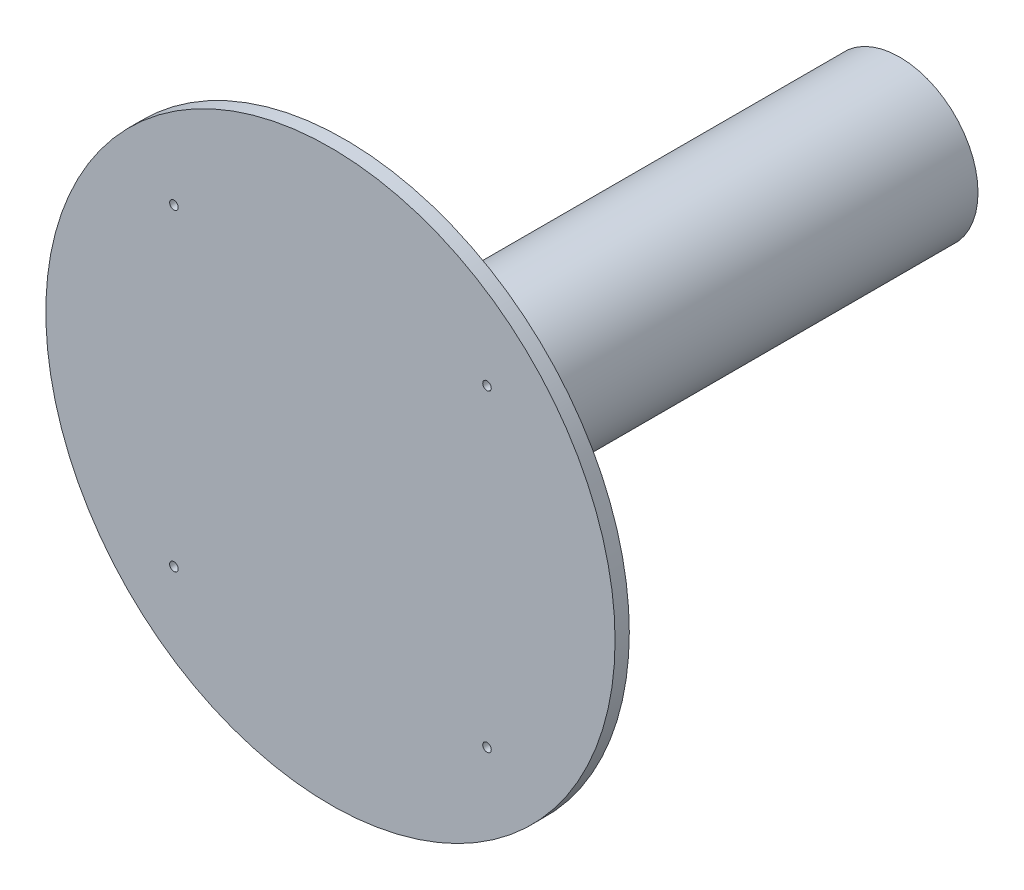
ISO-10303-21;
HEADER;
FILE_DESCRIPTION(('STEP AP214'),'2;1');
FILE_NAME('part.step','',(''),(''),'','','');
FILE_SCHEMA(('AUTOMOTIVE_DESIGN { 1 0 10303 214 1 1 1 1 }'));
ENDSEC;
DATA;
#1=APPLICATION_CONTEXT('core data for automotive mechanical design processes');
#2=APPLICATION_PROTOCOL_DEFINITION('international standard','automotive_design',2000,#1);
#3=PRODUCT_CONTEXT('',#1,'mechanical');
#4=PRODUCT('Part','Part','',(#3));
#5=PRODUCT_RELATED_PRODUCT_CATEGORY('part','',(#4));
#6=PRODUCT_DEFINITION_FORMATION('','',#4);
#7=PRODUCT_DEFINITION_CONTEXT('part definition',#1,'design');
#8=PRODUCT_DEFINITION('design','',#6,#7);
#9=PRODUCT_DEFINITION_SHAPE('','',#8);
#10=(LENGTH_UNIT() NAMED_UNIT(*) SI_UNIT(.MILLI.,.METRE.));
#11=(NAMED_UNIT(*) PLANE_ANGLE_UNIT() SI_UNIT($,.RADIAN.));
#12=(NAMED_UNIT(*) SI_UNIT($,.STERADIAN.) SOLID_ANGLE_UNIT());
#13=UNCERTAINTY_MEASURE_WITH_UNIT(LENGTH_MEASURE(1.E-05),#10,'distance_accuracy_value','');
#14=(GEOMETRIC_REPRESENTATION_CONTEXT(3) GLOBAL_UNCERTAINTY_ASSIGNED_CONTEXT((#13)) GLOBAL_UNIT_ASSIGNED_CONTEXT((#10,
#11,#12)) REPRESENTATION_CONTEXT('',''));
#15=CARTESIAN_POINT('',(0.,0.,0.));
#16=DIRECTION('',(0.,0.,1.));
#17=DIRECTION('',(1.,0.,0.));
#18=AXIS2_PLACEMENT_3D('',#15,#16,#17);
#19=CARTESIAN_POINT('',(0.,0.,5.));
#20=DIRECTION('',(0.,0.,-1.));
#21=DIRECTION('',(-1.,0.,0.));
#22=AXIS2_PLACEMENT_3D('',#19,#20,#21);
#23=CYLINDRICAL_SURFACE('',#22,100.);
#24=CARTESIAN_POINT('',(0.,0.,5.));
#25=DIRECTION('',(0.,0.,1.));
#26=DIRECTION('',(1.,0.,0.));
#27=AXIS2_PLACEMENT_3D('',#24,#25,#26);
#28=CIRCLE('',#27,100.);
#29=CARTESIAN_POINT('',(100.,0.,5.));
#30=VERTEX_POINT('',#29);
#31=EDGE_CURVE('E37',#30,#30,#28,.T.);
#32=ORIENTED_EDGE('',*,*,#31,.F.);
#33=EDGE_LOOP('',(#32));
#34=FACE_BOUND('',#33,.T.);
#35=CARTESIAN_POINT('',(0.,0.,0.));
#36=DIRECTION('',(0.,0.,1.));
#37=DIRECTION('',(1.,0.,0.));
#38=AXIS2_PLACEMENT_3D('',#35,#36,#37);
#39=CIRCLE('',#38,100.);
#40=CARTESIAN_POINT('',(100.,0.,0.));
#41=VERTEX_POINT('',#40);
#42=EDGE_CURVE('E41',#41,#41,#39,.T.);
#43=ORIENTED_EDGE('',*,*,#42,.T.);
#44=EDGE_LOOP('',(#43));
#45=FACE_BOUND('',#44,.T.);
#46=ADVANCED_FACE('F31',(#34,#45),#23,.T.);
#47=CARTESIAN_POINT('',(0.,0.,5.));
#48=DIRECTION('',(0.,0.,1.));
#49=DIRECTION('',(1.,0.,0.));
#50=AXIS2_PLACEMENT_3D('',#47,#48,#49);
#51=PLANE('',#50);
#52=CARTESIAN_POINT('',(55.,-55.,5.));
#53=DIRECTION('',(0.,0.,1.));
#54=DIRECTION('',(1.,0.,0.));
#55=AXIS2_PLACEMENT_3D('',#52,#53,#54);
#56=CIRCLE('',#55,1.5);
#57=CARTESIAN_POINT('',(56.5,-55.,5.));
#58=VERTEX_POINT('',#57);
#59=EDGE_CURVE('E77',#58,#58,#56,.T.);
#60=ORIENTED_EDGE('',*,*,#59,.F.);
#61=EDGE_LOOP('',(#60));
#62=FACE_BOUND('',#61,.T.);
#63=CARTESIAN_POINT('',(-55.,-55.,5.));
#64=DIRECTION('',(0.,0.,1.));
#65=DIRECTION('',(1.,0.,0.));
#66=AXIS2_PLACEMENT_3D('',#63,#64,#65);
#67=CIRCLE('',#66,1.5);
#68=CARTESIAN_POINT('',(-53.5,-55.,5.));
#69=VERTEX_POINT('',#68);
#70=EDGE_CURVE('E71',#69,#69,#67,.T.);
#71=ORIENTED_EDGE('',*,*,#70,.F.);
#72=EDGE_LOOP('',(#71));
#73=FACE_BOUND('',#72,.T.);
#74=CARTESIAN_POINT('',(55.,55.,5.));
#75=DIRECTION('',(0.,0.,1.));
#76=DIRECTION('',(1.,0.,0.));
#77=AXIS2_PLACEMENT_3D('',#74,#75,#76);
#78=CIRCLE('',#77,1.5);
#79=CARTESIAN_POINT('',(56.5,55.,5.));
#80=VERTEX_POINT('',#79);
#81=EDGE_CURVE('E65',#80,#80,#78,.T.);
#82=ORIENTED_EDGE('',*,*,#81,.F.);
#83=EDGE_LOOP('',(#82));
#84=FACE_BOUND('',#83,.T.);
#85=CARTESIAN_POINT('',(-55.,55.,5.));
#86=DIRECTION('',(0.,0.,1.));
#87=DIRECTION('',(1.,0.,0.));
#88=AXIS2_PLACEMENT_3D('',#85,#86,#87);
#89=CIRCLE('',#88,1.5);
#90=CARTESIAN_POINT('',(-53.5,55.,5.));
#91=VERTEX_POINT('',#90);
#92=EDGE_CURVE('E59',#91,#91,#89,.T.);
#93=ORIENTED_EDGE('',*,*,#92,.F.);
#94=EDGE_LOOP('',(#93));
#95=FACE_BOUND('',#94,.T.);
#96=ORIENTED_EDGE('',*,*,#31,.T.);
#97=EDGE_LOOP('',(#96));
#98=FACE_BOUND('',#97,.T.);
#99=ADVANCED_FACE('F83',(#62,#73,#84,#95,#98),#51,.T.);
#100=CARTESIAN_POINT('',(0.,0.,0.));
#101=DIRECTION('',(0.,0.,1.));
#102=DIRECTION('',(1.,0.,0.));
#103=AXIS2_PLACEMENT_3D('',#100,#101,#102);
#104=PLANE('',#103);
#105=CARTESIAN_POINT('',(55.,-55.,0.));
#106=DIRECTION('',(0.,0.,1.));
#107=DIRECTION('',(1.,0.,0.));
#108=AXIS2_PLACEMENT_3D('',#105,#106,#107);
#109=CIRCLE('',#108,1.5);
#110=CARTESIAN_POINT('',(56.5,-55.,0.));
#111=VERTEX_POINT('',#110);
#112=EDGE_CURVE('E74',#111,#111,#109,.T.);
#113=ORIENTED_EDGE('',*,*,#112,.T.);
#114=EDGE_LOOP('',(#113));
#115=FACE_BOUND('',#114,.T.);
#116=CARTESIAN_POINT('',(-55.,-55.,0.));
#117=DIRECTION('',(0.,0.,1.));
#118=DIRECTION('',(1.,0.,0.));
#119=AXIS2_PLACEMENT_3D('',#116,#117,#118);
#120=CIRCLE('',#119,1.5);
#121=CARTESIAN_POINT('',(-53.5,-55.,0.));
#122=VERTEX_POINT('',#121);
#123=EDGE_CURVE('E68',#122,#122,#120,.T.);
#124=ORIENTED_EDGE('',*,*,#123,.T.);
#125=EDGE_LOOP('',(#124));
#126=FACE_BOUND('',#125,.T.);
#127=CARTESIAN_POINT('',(55.,55.,0.));
#128=DIRECTION('',(0.,0.,1.));
#129=DIRECTION('',(1.,0.,0.));
#130=AXIS2_PLACEMENT_3D('',#127,#128,#129);
#131=CIRCLE('',#130,1.5);
#132=CARTESIAN_POINT('',(56.5,55.,0.));
#133=VERTEX_POINT('',#132);
#134=EDGE_CURVE('E62',#133,#133,#131,.T.);
#135=ORIENTED_EDGE('',*,*,#134,.T.);
#136=EDGE_LOOP('',(#135));
#137=FACE_BOUND('',#136,.T.);
#138=CARTESIAN_POINT('',(-55.,55.,0.));
#139=DIRECTION('',(0.,0.,1.));
#140=DIRECTION('',(1.,0.,0.));
#141=AXIS2_PLACEMENT_3D('',#138,#139,#140);
#142=CIRCLE('',#141,1.5);
#143=CARTESIAN_POINT('',(-53.5,55.,0.));
#144=VERTEX_POINT('',#143);
#145=EDGE_CURVE('E54',#144,#144,#142,.T.);
#146=ORIENTED_EDGE('',*,*,#145,.T.);
#147=EDGE_LOOP('',(#146));
#148=FACE_BOUND('',#147,.T.);
#149=CARTESIAN_POINT('',(0.,0.,0.));
#150=DIRECTION('',(0.,0.,1.));
#151=DIRECTION('',(1.,0.,0.));
#152=AXIS2_PLACEMENT_3D('',#149,#150,#151);
#153=CIRCLE('',#152,27.5);
#154=CARTESIAN_POINT('',(27.5,0.,0.));
#155=VERTEX_POINT('',#154);
#156=EDGE_CURVE('E10',#155,#155,#153,.F.);
#157=ORIENTED_EDGE('',*,*,#156,.F.);
#158=EDGE_LOOP('',(#157));
#159=FACE_BOUND('',#158,.T.);
#160=ORIENTED_EDGE('',*,*,#42,.F.);
#161=EDGE_LOOP('',(#160));
#162=FACE_BOUND('',#161,.T.);
#163=ADVANCED_FACE('F86',(#115,#126,#137,#148,#159,#162),#104,.F.);
#164=CARTESIAN_POINT('',(0.,0.,-195.));
#165=DIRECTION('',(0.,0.,-1.));
#166=DIRECTION('',(-1.,0.,0.));
#167=AXIS2_PLACEMENT_3D('',#164,#165,#166);
#168=PLANE('',#167);
#169=CARTESIAN_POINT('',(0.,0.,-195.));
#170=DIRECTION('',(0.,0.,-1.));
#171=DIRECTION('',(-1.,0.,0.));
#172=AXIS2_PLACEMENT_3D('',#169,#170,#171);
#173=CIRCLE('',#172,27.5);
#174=CARTESIAN_POINT('',(-27.5,0.,-195.));
#175=VERTEX_POINT('',#174);
#176=EDGE_CURVE('E46',#175,#175,#173,.T.);
#177=ORIENTED_EDGE('',*,*,#176,.T.);
#178=EDGE_LOOP('',(#177));
#179=FACE_BOUND('',#178,.T.);
#180=CARTESIAN_POINT('',(0.,0.,-195.));
#181=DIRECTION('',(0.,0.,-1.));
#182=DIRECTION('',(-1.,0.,0.));
#183=AXIS2_PLACEMENT_3D('',#180,#181,#182);
#184=CIRCLE('',#183,22.5);
#185=CARTESIAN_POINT('',(-22.5,0.,-195.));
#186=VERTEX_POINT('',#185);
#187=EDGE_CURVE('E50',#186,#186,#184,.T.);
#188=ORIENTED_EDGE('',*,*,#187,.F.);
#189=EDGE_LOOP('',(#188));
#190=FACE_BOUND('',#189,.T.);
#191=ADVANCED_FACE('F119',(#179,#190),#168,.T.);
#192=CARTESIAN_POINT('',(0.,0.,-195.));
#193=DIRECTION('',(0.,0.,1.));
#194=DIRECTION('',(1.,0.,0.));
#195=AXIS2_PLACEMENT_3D('',#192,#193,#194);
#196=CYLINDRICAL_SURFACE('',#195,27.5);
#197=ORIENTED_EDGE('',*,*,#176,.F.);
#198=EDGE_LOOP('',(#197));
#199=FACE_BOUND('',#198,.T.);
#200=ORIENTED_EDGE('',*,*,#156,.T.);
#201=EDGE_LOOP('',(#200));
#202=FACE_BOUND('',#201,.T.);
#203=ADVANCED_FACE('F124',(#199,#202),#196,.T.);
#204=CARTESIAN_POINT('',(0.,0.,-195.));
#205=DIRECTION('',(0.,0.,1.));
#206=DIRECTION('',(1.,0.,0.));
#207=AXIS2_PLACEMENT_3D('',#204,#205,#206);
#208=CYLINDRICAL_SURFACE('',#207,22.5);
#209=ORIENTED_EDGE('',*,*,#187,.T.);
#210=EDGE_LOOP('',(#209));
#211=FACE_BOUND('',#210,.T.);
#212=CARTESIAN_POINT('',(0.,0.,0.));
#213=DIRECTION('',(0.,0.,-1.));
#214=DIRECTION('',(-1.,0.,0.));
#215=AXIS2_PLACEMENT_3D('',#212,#213,#214);
#216=CIRCLE('',#215,22.5);
#217=CARTESIAN_POINT('',(-22.5,0.,0.));
#218=VERTEX_POINT('',#217);
#219=EDGE_CURVE('E51',#218,#218,#216,.T.);
#220=ORIENTED_EDGE('',*,*,#219,.F.);
#221=EDGE_LOOP('',(#220));
#222=FACE_BOUND('',#221,.T.);
#223=ADVANCED_FACE('F107',(#211,#222),#208,.F.);
#224=ORIENTED_EDGE('',*,*,#219,.T.);
#225=EDGE_LOOP('',(#224));
#226=FACE_BOUND('',#225,.T.);
#227=ADVANCED_FACE('F97',(#226),#104,.F.);
#228=CARTESIAN_POINT('',(-55.,55.,5.));
#229=DIRECTION('',(0.,0.,1.));
#230=DIRECTION('',(1.,0.,0.));
#231=AXIS2_PLACEMENT_3D('',#228,#229,#230);
#232=CYLINDRICAL_SURFACE('',#231,1.5);
#233=ORIENTED_EDGE('',*,*,#145,.F.);
#234=EDGE_LOOP('',(#233));
#235=FACE_BOUND('',#234,.T.);
#236=ORIENTED_EDGE('',*,*,#92,.T.);
#237=EDGE_LOOP('',(#236));
#238=FACE_BOUND('',#237,.T.);
#239=ADVANCED_FACE('F94',(#235,#238),#232,.F.);
#240=CARTESIAN_POINT('',(55.,55.,5.));
#241=DIRECTION('',(0.,0.,1.));
#242=DIRECTION('',(1.,0.,0.));
#243=AXIS2_PLACEMENT_3D('',#240,#241,#242);
#244=CYLINDRICAL_SURFACE('',#243,1.5);
#245=ORIENTED_EDGE('',*,*,#134,.F.);
#246=EDGE_LOOP('',(#245));
#247=FACE_BOUND('',#246,.T.);
#248=ORIENTED_EDGE('',*,*,#81,.T.);
#249=EDGE_LOOP('',(#248));
#250=FACE_BOUND('',#249,.T.);
#251=ADVANCED_FACE('F96',(#247,#250),#244,.F.);
#252=CARTESIAN_POINT('',(-55.,-55.,5.));
#253=DIRECTION('',(0.,0.,1.));
#254=DIRECTION('',(1.,0.,0.));
#255=AXIS2_PLACEMENT_3D('',#252,#253,#254);
#256=CYLINDRICAL_SURFACE('',#255,1.5);
#257=ORIENTED_EDGE('',*,*,#123,.F.);
#258=EDGE_LOOP('',(#257));
#259=FACE_BOUND('',#258,.T.);
#260=ORIENTED_EDGE('',*,*,#70,.T.);
#261=EDGE_LOOP('',(#260));
#262=FACE_BOUND('',#261,.T.);
#263=ADVANCED_FACE('F104',(#259,#262),#256,.F.);
#264=CARTESIAN_POINT('',(55.,-55.,5.));
#265=DIRECTION('',(0.,0.,1.));
#266=DIRECTION('',(1.,0.,0.));
#267=AXIS2_PLACEMENT_3D('',#264,#265,#266);
#268=CYLINDRICAL_SURFACE('',#267,1.5);
#269=ORIENTED_EDGE('',*,*,#112,.F.);
#270=EDGE_LOOP('',(#269));
#271=FACE_BOUND('',#270,.T.);
#272=ORIENTED_EDGE('',*,*,#59,.T.);
#273=EDGE_LOOP('',(#272));
#274=FACE_BOUND('',#273,.T.);
#275=ADVANCED_FACE('F81',(#271,#274),#268,.F.);
#276=CLOSED_SHELL('',(#46,#99,#163,#191,#203,#223,#227,#239,#251,#263,#275));
#277=MANIFOLD_SOLID_BREP('B2',#276);
#278=ADVANCED_BREP_SHAPE_REPRESENTATION('',(#18,#277),#14);
#279=SHAPE_DEFINITION_REPRESENTATION(#9,#278);
ENDSEC;
END-ISO-10303-21;
